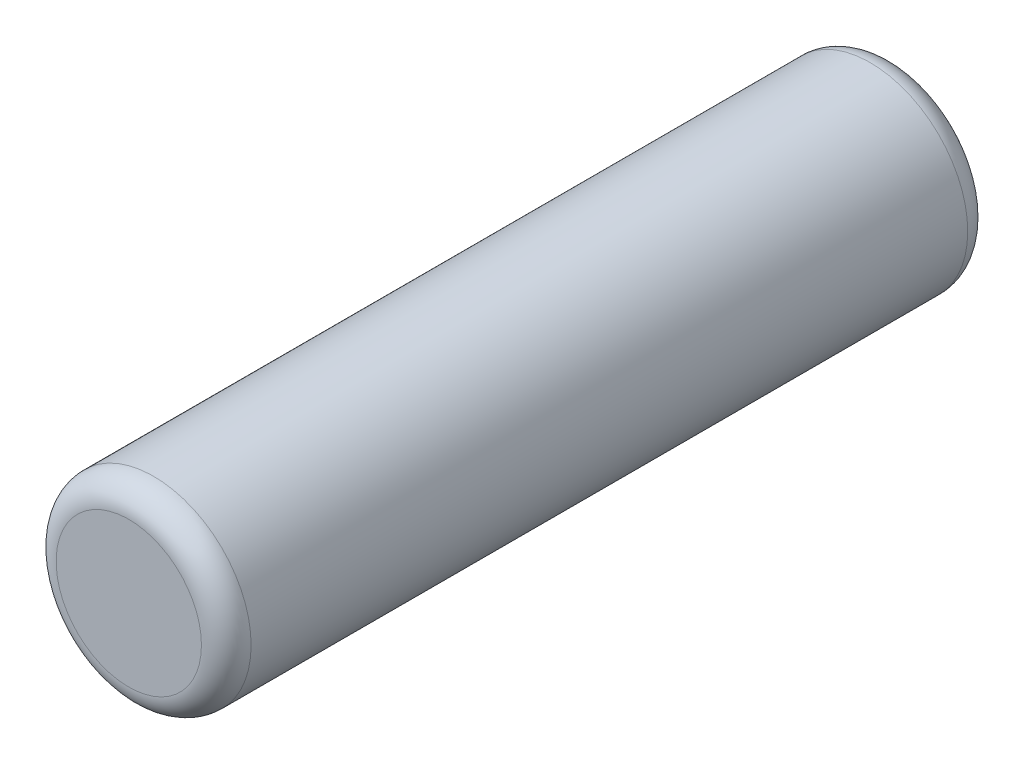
from build123d import *

# Parameters (mm, degrees)
SKETCH1_R          = 1.9939
BASE_EXTRUDE_DEPTH = 7.8359
FILLET1_R          = 0.508


with BuildPart() as part:
    # Sketch1 → Base-Extrude (new, symmetric)
    with BuildSketch(Plane.XY):
        Circle(SKETCH1_R)
    extrude(amount=BASE_EXTRUDE_DEPTH, both=True)

    # Fillet1
    fillet1_edges = [part.edges().sort_by_distance(p)[0] for p in [
        (-1.9939, 0, -7.8359),
        (-1.9939, 0, 7.8359),
    ]]
    fillet(fillet1_edges, radius=FILLET1_R)


solid = part.part
